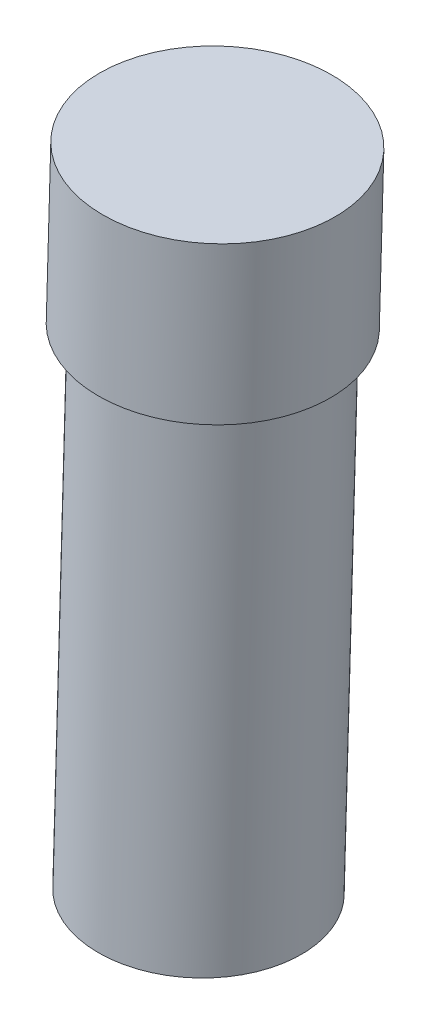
ISO-10303-21;
HEADER;
FILE_DESCRIPTION(('STEP AP214'),'2;1');
FILE_NAME('part.step','',(''),(''),'','','');
FILE_SCHEMA(('AUTOMOTIVE_DESIGN { 1 0 10303 214 1 1 1 1 }'));
ENDSEC;
DATA;
#1=APPLICATION_CONTEXT('core data for automotive mechanical design processes');
#2=APPLICATION_PROTOCOL_DEFINITION('international standard','automotive_design',2000,#1);
#3=PRODUCT_CONTEXT('',#1,'mechanical');
#4=PRODUCT('Part','Part','',(#3));
#5=PRODUCT_RELATED_PRODUCT_CATEGORY('part','',(#4));
#6=PRODUCT_DEFINITION_FORMATION('','',#4);
#7=PRODUCT_DEFINITION_CONTEXT('part definition',#1,'design');
#8=PRODUCT_DEFINITION('design','',#6,#7);
#9=PRODUCT_DEFINITION_SHAPE('','',#8);
#10=(LENGTH_UNIT() NAMED_UNIT(*) SI_UNIT(.MILLI.,.METRE.));
#11=(NAMED_UNIT(*) PLANE_ANGLE_UNIT() SI_UNIT($,.RADIAN.));
#12=(NAMED_UNIT(*) SI_UNIT($,.STERADIAN.) SOLID_ANGLE_UNIT());
#13=UNCERTAINTY_MEASURE_WITH_UNIT(LENGTH_MEASURE(1.E-05),#10,'distance_accuracy_value','');
#14=(GEOMETRIC_REPRESENTATION_CONTEXT(3) GLOBAL_UNCERTAINTY_ASSIGNED_CONTEXT((#13)) GLOBAL_UNIT_ASSIGNED_CONTEXT((#10,
#11,#12)) REPRESENTATION_CONTEXT('',''));
#15=CARTESIAN_POINT('',(0.,0.,0.));
#16=DIRECTION('',(0.,0.,1.));
#17=DIRECTION('',(1.,0.,0.));
#18=AXIS2_PLACEMENT_3D('',#15,#16,#17);
#19=CARTESIAN_POINT('',(-223.5172010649,-43.297489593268,-134.221294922));
#20=DIRECTION('',(0.0287732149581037,0.999585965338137,0.));
#21=DIRECTION('',(-0.999585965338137,0.0287732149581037,0.));
#22=AXIS2_PLACEMENT_3D('',#19,#20,#21);
#23=CYLINDRICAL_SURFACE('',#22,7.);
#24=CARTESIAN_POINT('',(-223.511408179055,-43.0962438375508,-134.221294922));
#25=DIRECTION('',(0.0287732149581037,0.999585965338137,0.));
#26=DIRECTION('',(-0.999585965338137,0.0287732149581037,0.));
#27=AXIS2_PLACEMENT_3D('',#24,#25,#26);
#28=CIRCLE('',#27,6.99999999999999);
#29=CARTESIAN_POINT('',(-230.508509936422,-42.894831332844,-134.221294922));
#30=VERTEX_POINT('',#29);
#31=EDGE_CURVE('E47',#30,#30,#28,.T.);
#32=ORIENTED_EDGE('',*,*,#31,.T.);
#33=EDGE_LOOP('',(#32));
#34=FACE_BOUND('',#33,.T.);
#35=CARTESIAN_POINT('',(-222.540207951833,-9.35659680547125,-134.221294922));
#36=DIRECTION('',(0.0287732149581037,0.999585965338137,0.));
#37=DIRECTION('',(-0.999585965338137,0.0287732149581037,0.));
#38=AXIS2_PLACEMENT_3D('',#35,#36,#37);
#39=CIRCLE('',#38,6.99999999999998);
#40=CARTESIAN_POINT('',(-229.5373097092,-9.15518430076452,-134.221294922));
#41=VERTEX_POINT('',#40);
#42=EDGE_CURVE('E10',#41,#41,#39,.T.);
#43=ORIENTED_EDGE('',*,*,#42,.F.);
#44=EDGE_LOOP('',(#43));
#45=FACE_BOUND('',#44,.T.);
#46=ADVANCED_FACE('F33',(#34,#45),#23,.T.);
#47=CARTESIAN_POINT('',(-214.543520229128,-9.5867825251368,-134.221294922));
#48=DIRECTION('',(-0.0287732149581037,-0.999585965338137,0.));
#49=DIRECTION('',(0.999585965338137,-0.0287732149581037,0.));
#50=AXIS2_PLACEMENT_3D('',#47,#48,#49);
#51=PLANE('',#50);
#52=ORIENTED_EDGE('',*,*,#42,.T.);
#53=EDGE_LOOP('',(#52));
#54=FACE_BOUND('',#53,.T.);
#55=CARTESIAN_POINT('',(-222.540207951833,-9.35659680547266,-134.221294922));
#56=DIRECTION('',(0.0287732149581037,0.999585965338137,0.));
#57=DIRECTION('',(-0.999585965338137,0.0287732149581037,0.));
#58=AXIS2_PLACEMENT_3D('',#55,#56,#57);
#59=CIRCLE('',#58,8.00000000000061);
#60=CARTESIAN_POINT('',(-230.536895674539,-9.12641108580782,-134.221294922));
#61=VERTEX_POINT('',#60);
#62=EDGE_CURVE('E39',#61,#61,#59,.T.);
#63=ORIENTED_EDGE('',*,*,#62,.F.);
#64=EDGE_LOOP('',(#63));
#65=FACE_BOUND('',#64,.T.);
#66=ADVANCED_FACE('F66',(#54,#65),#51,.T.);
#67=CARTESIAN_POINT('',(-223.5172010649,-43.297489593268,-134.221294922));
#68=DIRECTION('',(0.0287732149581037,0.999585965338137,0.));
#69=DIRECTION('',(-0.999585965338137,0.0287732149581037,0.));
#70=AXIS2_PLACEMENT_3D('',#67,#68,#69);
#71=CYLINDRICAL_SURFACE('',#70,8.0000000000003);
#72=ORIENTED_EDGE('',*,*,#62,.T.);
#73=EDGE_LOOP('',(#72));
#74=FACE_BOUND('',#73,.T.);
#75=CARTESIAN_POINT('',(-222.229314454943,1.44389165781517,-134.221294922));
#76=DIRECTION('',(0.0287732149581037,0.999585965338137,0.));
#77=DIRECTION('',(-0.999585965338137,0.0287732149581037,0.));
#78=AXIS2_PLACEMENT_3D('',#75,#76,#77);
#79=CIRCLE('',#78,8.);
#80=CARTESIAN_POINT('',(-230.226002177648,1.67407737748,-134.221294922));
#81=VERTEX_POINT('',#80);
#82=EDGE_CURVE('E43',#81,#81,#79,.T.);
#83=ORIENTED_EDGE('',*,*,#82,.F.);
#84=EDGE_LOOP('',(#83));
#85=FACE_BOUND('',#84,.T.);
#86=ADVANCED_FACE('F62',(#74,#85),#71,.T.);
#87=CARTESIAN_POINT('',(-222.229314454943,1.44389165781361,-134.221294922));
#88=DIRECTION('',(0.0287732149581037,0.999585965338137,0.));
#89=DIRECTION('',(-0.999585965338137,0.0287732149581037,0.));
#90=AXIS2_PLACEMENT_3D('',#87,#88,#89);
#91=PLANE('',#90);
#92=ORIENTED_EDGE('',*,*,#82,.T.);
#93=EDGE_LOOP('',(#92));
#94=FACE_BOUND('',#93,.T.);
#95=ADVANCED_FACE('F57',(#94),#91,.T.);
#96=CARTESIAN_POINT('',(-216.514306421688,-43.2976563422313,-134.221294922));
#97=DIRECTION('',(-0.0287732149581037,-0.999585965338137,0.));
#98=DIRECTION('',(0.999585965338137,-0.0287732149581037,0.));
#99=AXIS2_PLACEMENT_3D('',#96,#97,#98);
#100=PLANE('',#99);
#101=ORIENTED_EDGE('',*,*,#31,.F.);
#102=EDGE_LOOP('',(#101));
#103=FACE_BOUND('',#102,.T.);
#104=ADVANCED_FACE('F55',(#103),#100,.T.);
#105=CLOSED_SHELL('',(#46,#66,#86,#95,#104));
#106=MANIFOLD_SOLID_BREP('B2',#105);
#107=ADVANCED_BREP_SHAPE_REPRESENTATION('',(#18,#106),#14);
#108=SHAPE_DEFINITION_REPRESENTATION(#9,#107);
ENDSEC;
END-ISO-10303-21;
